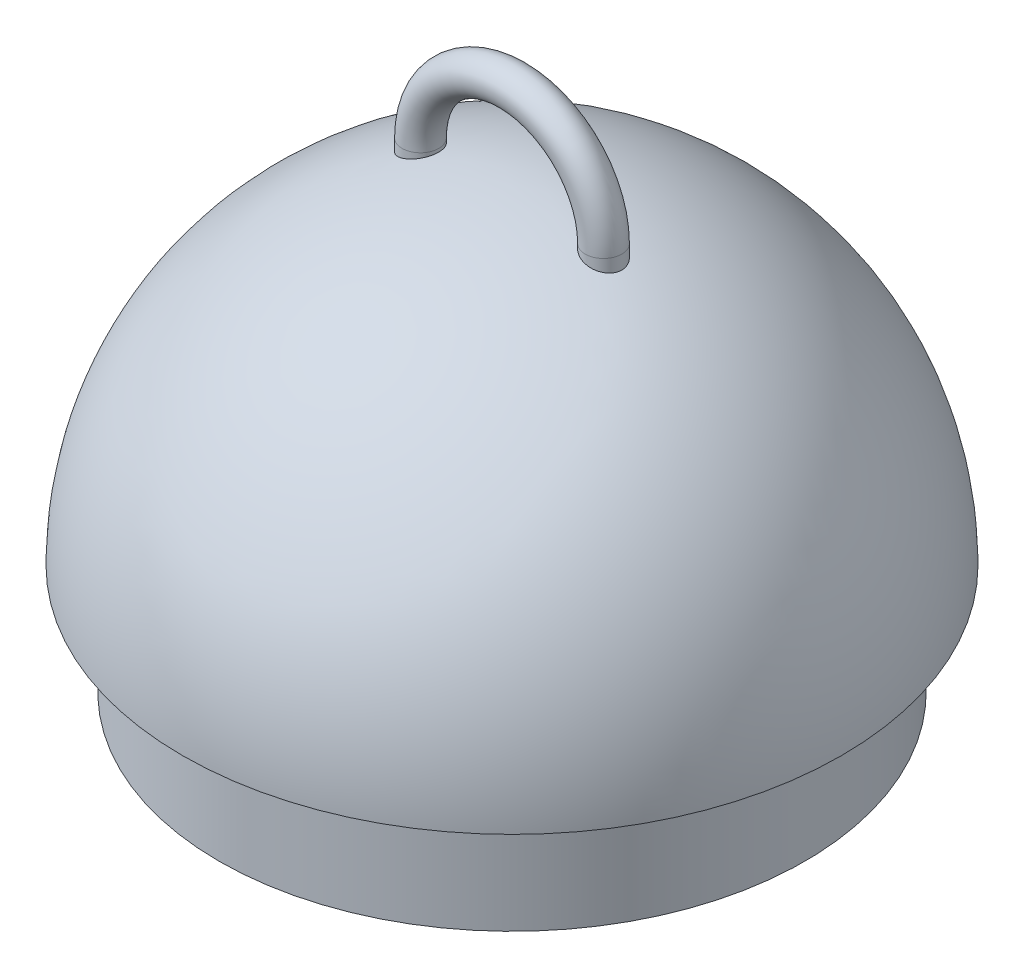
ISO-10303-21;
HEADER;
FILE_DESCRIPTION(('STEP AP214'),'2;1');
FILE_NAME('part.step','',(''),(''),'','','');
FILE_SCHEMA(('AUTOMOTIVE_DESIGN { 1 0 10303 214 1 1 1 1 }'));
ENDSEC;
DATA;
#1=APPLICATION_CONTEXT('core data for automotive mechanical design processes');
#2=APPLICATION_PROTOCOL_DEFINITION('international standard','automotive_design',2000,#1);
#3=PRODUCT_CONTEXT('',#1,'mechanical');
#4=PRODUCT('Part','Part','',(#3));
#5=PRODUCT_RELATED_PRODUCT_CATEGORY('part','',(#4));
#6=PRODUCT_DEFINITION_FORMATION('','',#4);
#7=PRODUCT_DEFINITION_CONTEXT('part definition',#1,'design');
#8=PRODUCT_DEFINITION('design','',#6,#7);
#9=PRODUCT_DEFINITION_SHAPE('','',#8);
#10=(LENGTH_UNIT() NAMED_UNIT(*) SI_UNIT(.MILLI.,.METRE.));
#11=(NAMED_UNIT(*) PLANE_ANGLE_UNIT() SI_UNIT($,.RADIAN.));
#12=(NAMED_UNIT(*) SI_UNIT($,.STERADIAN.) SOLID_ANGLE_UNIT());
#13=UNCERTAINTY_MEASURE_WITH_UNIT(LENGTH_MEASURE(1.E-05),#10,'distance_accuracy_value','');
#14=(GEOMETRIC_REPRESENTATION_CONTEXT(3) GLOBAL_UNCERTAINTY_ASSIGNED_CONTEXT((#13)) GLOBAL_UNIT_ASSIGNED_CONTEXT((#10,
#11,#12)) REPRESENTATION_CONTEXT('',''));
#15=CARTESIAN_POINT('',(0.,0.,0.));
#16=DIRECTION('',(0.,0.,1.));
#17=DIRECTION('',(1.,0.,0.));
#18=AXIS2_PLACEMENT_3D('',#15,#16,#17);
#19=CARTESIAN_POINT('',(0.,30.,0.));
#20=DIRECTION('',(0.,-1.,0.));
#21=DIRECTION('',(0.,0.,-1.));
#22=AXIS2_PLACEMENT_3D('',#19,#20,#21);
#23=CYLINDRICAL_SURFACE('',#22,80.);
#24=CARTESIAN_POINT('',(0.,30.,0.));
#25=DIRECTION('',(0.,1.,0.));
#26=DIRECTION('',(0.,0.,1.));
#27=AXIS2_PLACEMENT_3D('',#24,#25,#26);
#28=CIRCLE('',#27,80.);
#29=CARTESIAN_POINT('',(0.,30.,80.));
#30=VERTEX_POINT('',#29);
#31=EDGE_CURVE('E10',#30,#30,#28,.T.);
#32=ORIENTED_EDGE('',*,*,#31,.F.);
#33=EDGE_LOOP('',(#32));
#34=FACE_BOUND('',#33,.T.);
#35=CARTESIAN_POINT('',(0.,0.,0.));
#36=DIRECTION('',(0.,1.,0.));
#37=DIRECTION('',(0.,0.,1.));
#38=AXIS2_PLACEMENT_3D('',#35,#36,#37);
#39=CIRCLE('',#38,80.);
#40=CARTESIAN_POINT('',(0.,0.,80.));
#41=VERTEX_POINT('',#40);
#42=EDGE_CURVE('E56',#41,#41,#39,.T.);
#43=ORIENTED_EDGE('',*,*,#42,.T.);
#44=EDGE_LOOP('',(#43));
#45=FACE_BOUND('',#44,.T.);
#46=ADVANCED_FACE('F43',(#34,#45),#23,.T.);
#47=CARTESIAN_POINT('',(0.,0.,0.));
#48=DIRECTION('',(0.,1.,0.));
#49=DIRECTION('',(0.,0.,1.));
#50=AXIS2_PLACEMENT_3D('',#47,#48,#49);
#51=PLANE('',#50);
#52=ORIENTED_EDGE('',*,*,#42,.F.);
#53=EDGE_LOOP('',(#52));
#54=FACE_BOUND('',#53,.T.);
#55=ADVANCED_FACE('F91',(#54),#51,.F.);
#56=CARTESIAN_POINT('',(0.,30.,0.));
#57=DIRECTION('',(-1.,0.,0.));
#58=DIRECTION('',(0.,0.,-1.));
#59=AXIS2_PLACEMENT_3D('',#56,#57,#58);
#60=SPHERICAL_SURFACE('',#59,90.);
#61=CARTESIAN_POINT('',(-28.6440533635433,115.251377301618,-3.42357635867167));
#62=CARTESIAN_POINT('',(-28.5452385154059,115.280354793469,-3.52875500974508));
#63=CARTESIAN_POINT('',(-28.4420447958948,115.310601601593,-3.62946385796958));
#64=CARTESIAN_POINT('',(-28.2277098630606,115.373388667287,-3.82133293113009));
#65=CARTESIAN_POINT('',(-28.1165657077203,115.405929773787,-3.91248959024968));
#66=CARTESIAN_POINT('',(-27.8870981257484,115.473073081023,-4.08476122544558));
#67=CARTESIAN_POINT('',(-27.7687654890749,115.507677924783,-4.16586289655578));
#68=CARTESIAN_POINT('',(-27.5259173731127,115.57865032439,-4.31743442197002));
#69=CARTESIAN_POINT('',(-27.4013995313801,115.615018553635,-4.38790017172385));
#70=CARTESIAN_POINT('',(-27.1474356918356,115.689145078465,-4.51760926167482));
#71=CARTESIAN_POINT('',(-27.0180020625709,115.726899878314,-4.57687878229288));
#72=CARTESIAN_POINT('',(-26.7548521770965,115.803606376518,-4.68409151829));
#73=CARTESIAN_POINT('',(-26.6211343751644,115.842558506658,-4.73203059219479));
#74=CARTESIAN_POINT('',(-26.2151288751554,115.960745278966,-4.85835505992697));
#75=CARTESIAN_POINT('',(-25.9376475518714,116.041410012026,-4.91942125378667));
#76=CARTESIAN_POINT('',(-25.3700648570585,116.20616983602,-4.99470709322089));
#77=CARTESIAN_POINT('',(-25.0798207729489,116.290300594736,-5.00774650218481));
#78=CARTESIAN_POINT('',(-24.5011346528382,116.457794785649,-4.98346972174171));
#79=CARTESIAN_POINT('',(-24.2126929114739,116.54115809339,-4.94614550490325));
#80=CARTESIAN_POINT('',(-23.6430126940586,116.705571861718,-4.8212497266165));
#81=CARTESIAN_POINT('',(-23.3618713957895,116.78659199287,-4.73319363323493));
#82=CARTESIAN_POINT('',(-22.8180774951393,116.943097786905,-4.5084084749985));
#83=CARTESIAN_POINT('',(-22.5554238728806,117.018583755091,-4.37168209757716));
#84=CARTESIAN_POINT('',(-22.060970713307,117.160521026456,-4.05546549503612));
#85=CARTESIAN_POINT('',(-21.8287332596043,117.227100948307,-3.87671880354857));
#86=CARTESIAN_POINT('',(-21.3977105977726,117.350548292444,-3.47983862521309));
#87=CARTESIAN_POINT('',(-21.1989187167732,117.407417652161,-3.26171301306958));
#88=CARTESIAN_POINT('',(-20.8480787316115,117.507705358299,-2.80045307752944));
#89=CARTESIAN_POINT('',(-20.6946275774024,117.551527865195,-2.55847423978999));
#90=CARTESIAN_POINT('',(-20.4307538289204,117.626843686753,-2.05033741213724));
#91=CARTESIAN_POINT('',(-20.3203209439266,117.658339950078,-1.78418522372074));
#92=CARTESIAN_POINT('',(-20.1498607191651,117.706941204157,-1.24610821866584));
#93=CARTESIAN_POINT('',(-20.0880878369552,117.724544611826,-0.974780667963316));
#94=CARTESIAN_POINT('',(-20.0103843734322,117.74668601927,-0.425129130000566));
#95=CARTESIAN_POINT('',(-19.9944463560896,117.751226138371,-0.146806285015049));
#96=CARTESIAN_POINT('',(-20.0088102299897,117.747133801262,0.402073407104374));
#97=CARTESIAN_POINT('',(-20.0380515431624,117.738803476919,0.672661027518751));
#98=CARTESIAN_POINT('',(-20.139787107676,117.709810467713,1.20487630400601));
#99=CARTESIAN_POINT('',(-20.2122801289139,117.689148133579,1.46650421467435));
#100=CARTESIAN_POINT('',(-20.3981334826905,117.636145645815,1.97379628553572));
#101=CARTESIAN_POINT('',(-20.5115306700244,117.603794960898,2.21944581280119));
#102=CARTESIAN_POINT('',(-20.7754791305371,117.528437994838,2.6880792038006));
#103=CARTESIAN_POINT('',(-20.9260338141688,117.485430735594,2.91106098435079));
#104=CARTESIAN_POINT('',(-21.2636262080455,117.388907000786,3.33382727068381));
#105=CARTESIAN_POINT('',(-21.451443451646,117.335165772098,3.53293738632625));
#106=CARTESIAN_POINT('',(-21.8555100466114,117.219423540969,3.89694340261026));
#107=CARTESIAN_POINT('',(-22.0717641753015,117.157421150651,4.061833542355));
#108=CARTESIAN_POINT('',(-22.5349923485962,117.024450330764,4.35915345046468));
#109=CARTESIAN_POINT('',(-22.7828019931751,116.95323652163,4.49017148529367));
#110=CARTESIAN_POINT('',(-23.2954781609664,116.805711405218,4.70874766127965));
#111=CARTESIAN_POINT('',(-23.560347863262,116.729399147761,4.79629767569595));
#112=CARTESIAN_POINT('',(-24.1095924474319,116.570935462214,4.92846020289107));
#113=CARTESIAN_POINT('',(-24.3943257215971,116.488673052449,4.97145317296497));
#114=CARTESIAN_POINT('',(-24.9666558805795,116.323079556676,5.00810871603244));
#115=CARTESIAN_POINT('',(-25.2542531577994,116.239748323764,5.00176443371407));
#116=CARTESIAN_POINT('',(-25.8299515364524,116.072699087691,4.93928826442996));
#117=CARTESIAN_POINT('',(-26.1179572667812,115.989004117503,4.88220739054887));
#118=CARTESIAN_POINT('',(-26.6805075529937,115.825295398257,4.71824023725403));
#119=CARTESIAN_POINT('',(-26.9550519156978,115.745281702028,4.61135324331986));
#120=CARTESIAN_POINT('',(-27.4809687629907,115.591806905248,4.35088564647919));
#121=CARTESIAN_POINT('',(-27.7324765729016,115.518307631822,4.19760403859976));
#122=CARTESIAN_POINT('',(-28.0875334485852,115.414428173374,3.93559252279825));
#123=CARTESIAN_POINT('',(-28.2022385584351,115.38084752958,3.84285082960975));
#124=CARTESIAN_POINT('',(-28.4233619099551,115.316076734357,3.64723718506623));
#125=CARTESIAN_POINT('',(-28.5297837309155,115.284885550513,3.54436965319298));
#126=CARTESIAN_POINT('',(-28.7303672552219,115.226066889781,3.33241932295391));
#127=CARTESIAN_POINT('',(-28.8248007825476,115.198360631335,3.22361514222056));
#128=CARTESIAN_POINT('',(-29.0041769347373,115.145709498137,2.99788852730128));
#129=CARTESIAN_POINT('',(-29.0891234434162,115.120763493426,2.88096944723));
#130=CARTESIAN_POINT('',(-29.2488144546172,115.073849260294,2.63979060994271));
#131=CARTESIAN_POINT('',(-29.3235587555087,115.051881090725,2.5155307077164));
#132=CARTESIAN_POINT('',(-29.4621537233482,115.011132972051,2.26058238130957));
#133=CARTESIAN_POINT('',(-29.5260050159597,114.992352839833,2.1298943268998));
#134=CARTESIAN_POINT('',(-29.639841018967,114.958861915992,1.86851804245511));
#135=CARTESIAN_POINT('',(-29.6902847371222,114.94401649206,1.73804680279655));
#136=CARTESIAN_POINT('',(-29.7801377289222,114.917567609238,1.47304309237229));
#137=CARTESIAN_POINT('',(-29.8195475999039,114.905963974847,1.33851084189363));
#138=CARTESIAN_POINT('',(-29.886971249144,114.886109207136,1.06637831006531));
#139=CARTESIAN_POINT('',(-29.9149851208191,114.877858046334,0.928778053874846));
#140=CARTESIAN_POINT('',(-29.9593449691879,114.864791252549,0.65160331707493));
#141=CARTESIAN_POINT('',(-29.975695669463,114.859974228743,0.512029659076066));
#142=CARTESIAN_POINT('',(-29.9962657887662,114.853913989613,0.236304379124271));
#143=CARTESIAN_POINT('',(-30.0008482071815,114.852563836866,0.100182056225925));
#144=CARTESIAN_POINT('',(-29.9988944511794,114.853139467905,-0.171923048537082));
#145=CARTESIAN_POINT('',(-29.9923626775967,114.855063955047,-0.307905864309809));
#146=CARTESIAN_POINT('',(-29.9682404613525,114.862170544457,-0.578877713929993));
#147=CARTESIAN_POINT('',(-29.9506437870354,114.867354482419,-0.713866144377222));
#148=CARTESIAN_POINT('',(-29.9045513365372,114.880931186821,-0.981754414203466));
#149=CARTESIAN_POINT('',(-29.876059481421,114.88932279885,-1.11465498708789));
#150=CARTESIAN_POINT('',(-29.8086517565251,114.909172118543,-1.37660353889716));
#151=CARTESIAN_POINT('',(-29.7698063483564,114.920609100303,-1.50567123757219));
#152=CARTESIAN_POINT('',(-29.6819546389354,114.946468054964,-1.75993961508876));
#153=CARTESIAN_POINT('',(-29.6329519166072,114.960888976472,-1.88514163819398));
#154=CARTESIAN_POINT('',(-29.5252330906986,114.992579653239,-2.13078258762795));
#155=CARTESIAN_POINT('',(-29.4665258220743,115.009846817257,-2.25122572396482));
#156=CARTESIAN_POINT('',(-29.3398627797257,115.047088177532,-2.48665563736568));
#157=CARTESIAN_POINT('',(-29.2719096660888,115.067061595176,-2.60164397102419));
#158=CARTESIAN_POINT('',(-29.1176399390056,115.1123879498,-2.84039337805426));
#159=CARTESIAN_POINT('',(-29.0300829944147,115.138103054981,-2.96328656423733));
#160=CARTESIAN_POINT('',(-28.8446097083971,115.192548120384,-3.20025258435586));
#161=CARTESIAN_POINT('',(-28.746693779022,115.221277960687,-3.31432576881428));
#162=CARTESIAN_POINT('',(-28.6440533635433,115.251377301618,-3.42357635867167));
#163=B_SPLINE_CURVE_WITH_KNOTS('',3,(#61,#62,#63,#64,#65,#66,#67,#68,#69,#70,#71,#72,#73,#74,
#75,#76,#77,#78,#79,#80,#81,#82,#83,#84,#85,#86,#87,#88,#89,#90,#91,#92,#93,#94,#95,#96,#97,#98,
#99,#100,#101,#102,#103,#104,#105,#106,#107,#108,#109,#110,#111,#112,#113,#114,#115,#116,#117,
#118,#119,#120,#121,#122,#123,#124,#125,#126,#127,#128,#129,#130,#131,#132,#133,#134,#135,#136,
#137,#138,#139,#140,#141,#142,#143,#144,#145,#146,#147,#148,#149,#150,#151,#152,#153,#154,#155,
#156,#157,#158,#159,#160,#161,#162),.UNSPECIFIED.,.T.,.F.,(4,2,2,2,2,2,2,2,2,2,2,2,2,2,2,2,2,2,
2,2,2,2,2,2,2,2,2,2,2,2,2,2,2,2,2,2,2,2,2,2,2,2,2,2,2,2,2,2,2,2,4),(0.,0.441445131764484,
0.883054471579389,1.32524205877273,1.76759985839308,2.20891011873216,2.65038143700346,
3.53215081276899,4.43544995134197,5.33889308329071,6.25111137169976,7.1632792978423,
8.06038282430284,8.95730715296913,9.82255065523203,10.6875870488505,11.5199661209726,
12.3522101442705,13.1652121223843,13.9781909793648,14.7919041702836,15.6056920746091,
16.4387515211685,17.2719510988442,18.1356982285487,18.9996067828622,19.8939190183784,
20.7883555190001,21.6998822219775,22.6114220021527,23.5172080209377,23.970570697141,
24.4237363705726,24.8633224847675,25.3027279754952,25.7421421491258,26.181531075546,
26.6030162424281,27.0244785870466,27.4459374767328,27.8672255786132,28.2753535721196,
28.6833199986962,29.0915163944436,29.4995660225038,29.9049065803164,30.3101045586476,
30.7149356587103,31.1196505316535,31.5782042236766,32.0367396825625),.UNSPECIFIED.);
#164=CARTESIAN_POINT('',(-28.6440533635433,115.251377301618,-3.42357635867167));
#165=VERTEX_POINT('',#164);
#166=EDGE_CURVE('E46',#165,#165,#163,.T.);
#167=ORIENTED_EDGE('',*,*,#166,.T.);
#168=EDGE_LOOP('',(#167));
#169=FACE_BOUND('',#168,.T.);
#170=CARTESIAN_POINT('',(20.8636335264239,117.503247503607,-2.80899846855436));
#171=CARTESIAN_POINT('',(20.943726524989,117.48036463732,-2.92693906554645));
#172=CARTESIAN_POINT('',(21.0287367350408,117.456067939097,-3.04125956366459));
#173=CARTESIAN_POINT('',(21.2079011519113,117.404837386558,-3.26193079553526));
#174=CARTESIAN_POINT('',(21.3020586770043,117.377902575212,-3.36827861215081));
#175=CARTESIAN_POINT('',(21.4988382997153,117.321583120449,-3.57239251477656));
#176=CARTESIAN_POINT('',(21.601470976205,117.292195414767,-3.67014755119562));
#177=CARTESIAN_POINT('',(21.814316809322,117.231216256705,-3.85634894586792));
#178=CARTESIAN_POINT('',(21.9245328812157,117.199623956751,-3.94479169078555));
#179=CARTESIAN_POINT('',(22.1513872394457,117.134560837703,-4.11158949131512));
#180=CARTESIAN_POINT('',(22.2680086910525,117.101094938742,-4.18996933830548));
#181=CARTESIAN_POINT('',(22.5070661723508,117.032452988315,-4.33646938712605));
#182=CARTESIAN_POINT('',(22.6295043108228,116.997276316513,-4.40458583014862));
#183=CARTESIAN_POINT('',(23.0040774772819,116.889592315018,-4.59284280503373));
#184=CARTESIAN_POINT('',(23.2637702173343,116.814845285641,-4.69710970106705));
#185=CARTESIAN_POINT('',(23.8031842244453,116.659373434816,-4.86308437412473));
#186=CARTESIAN_POINT('',(24.0832634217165,116.578539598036,-4.92351226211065));
#187=CARTESIAN_POINT('',(24.6491524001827,116.414981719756,-4.99582392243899));
#188=CARTESIAN_POINT('',(24.9349633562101,116.33225729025,-5.00769763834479));
#189=CARTESIAN_POINT('',(25.5111500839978,116.165246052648,-4.98234872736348));
#190=CARTESIAN_POINT('',(25.8014785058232,116.08096737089,-4.94398399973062));
#191=CARTESIAN_POINT('',(26.3717859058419,115.915176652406,-4.81700579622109));
#192=CARTESIAN_POINT('',(26.6517644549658,115.833664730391,-4.7283902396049));
#193=CARTESIAN_POINT('',(27.1928058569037,115.675935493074,-4.50303864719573));
#194=CARTESIAN_POINT('',(27.4538938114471,115.599711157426,-4.36636793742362));
#195=CARTESIAN_POINT('',(27.9494848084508,115.454847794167,-4.04811359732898));
#196=CARTESIAN_POINT('',(28.1839911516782,115.386207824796,-3.86653555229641));
#197=CARTESIAN_POINT('',(28.6128396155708,115.260552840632,-3.46852773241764));
#198=CARTESIAN_POINT('',(28.8080847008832,115.203277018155,-3.25315433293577));
#199=CARTESIAN_POINT('',(29.1593176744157,115.100157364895,-2.79006495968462));
#200=CARTESIAN_POINT('',(29.3153151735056,115.054310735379,-2.5423569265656));
#201=CARTESIAN_POINT('',(29.5769336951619,114.977377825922,-2.03236132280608));
#202=CARTESIAN_POINT('',(29.684331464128,114.945771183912,-1.77106354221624));
#203=CARTESIAN_POINT('',(29.8537942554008,114.895882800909,-1.2329600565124));
#204=CARTESIAN_POINT('',(29.9158697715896,114.877597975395,-0.956157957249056));
#205=CARTESIAN_POINT('',(29.991035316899,114.855455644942,-0.405210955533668));
#206=CARTESIAN_POINT('',(30.0057449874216,114.851121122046,-0.13130514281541));
#207=CARTESIAN_POINT('',(29.9902271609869,114.855693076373,0.415102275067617));
#208=CARTESIAN_POINT('',(29.9600042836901,114.864598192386,0.687604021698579));
#209=CARTESIAN_POINT('',(29.8563707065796,114.895121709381,1.21995807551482));
#210=CARTESIAN_POINT('',(29.7835028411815,114.916580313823,1.47992569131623));
#211=CARTESIAN_POINT('',(29.5975089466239,114.971320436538,1.98368771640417));
#212=CARTESIAN_POINT('',(29.4843812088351,115.004602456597,2.2274814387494));
#213=CARTESIAN_POINT('',(29.2196271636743,115.082431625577,2.69595774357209));
#214=CARTESIAN_POINT('',(29.0674655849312,115.127135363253,2.92031134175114));
#215=CARTESIAN_POINT('',(28.7302507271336,115.226110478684,3.34032922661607));
#216=CARTESIAN_POINT('',(28.5451925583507,115.280383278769,3.53598924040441));
#217=CARTESIAN_POINT('',(28.140744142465,115.398866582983,3.90029570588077));
#218=CARTESIAN_POINT('',(27.9203947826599,115.463353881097,4.0677868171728));
#219=CARTESIAN_POINT('',(27.456626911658,115.598909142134,4.36356169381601));
#220=CARTESIAN_POINT('',(27.2132039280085,115.669978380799,4.49183783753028));
#221=CARTESIAN_POINT('',(26.6999551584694,115.819625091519,4.71073247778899));
#222=CARTESIAN_POINT('',(26.4294679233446,115.898387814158,4.79967432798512));
#223=CARTESIAN_POINT('',(25.8781115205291,116.058705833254,4.93043754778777));
#224=CARTESIAN_POINT('',(25.5972405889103,116.140261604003,4.97225087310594));
#225=CARTESIAN_POINT('',(25.0247880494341,116.306243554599,5.0083875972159));
#226=CARTESIAN_POINT('',(24.7331260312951,116.390686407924,5.00135564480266));
#227=CARTESIAN_POINT('',(24.1547857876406,116.557886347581,4.93661496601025));
#228=CARTESIAN_POINT('',(23.8681079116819,116.640643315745,4.87890269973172));
#229=CARTESIAN_POINT('',(23.4477420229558,116.761826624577,4.75521424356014));
#230=CARTESIAN_POINT('',(23.3088612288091,116.80183461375,4.70761616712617));
#231=CARTESIAN_POINT('',(23.0355157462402,116.880525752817,4.60025256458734));
#232=CARTESIAN_POINT('',(22.9010493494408,116.91920941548,4.54049181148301));
#233=CARTESIAN_POINT('',(22.637510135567,116.994976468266,4.40911983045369));
#234=CARTESIAN_POINT('',(22.5084392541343,117.032059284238,4.3375043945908));
#235=CARTESIAN_POINT('',(22.2568036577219,117.104311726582,4.18290159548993));
#236=CARTESIAN_POINT('',(22.1342362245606,117.139482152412,4.0999190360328));
#237=CARTESIAN_POINT('',(21.8990372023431,117.206933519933,3.92492884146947));
#238=CARTESIAN_POINT('',(21.7862518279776,117.239259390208,3.83314520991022));
#239=CARTESIAN_POINT('',(21.5687971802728,117.301552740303,3.63978101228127));
#240=CARTESIAN_POINT('',(21.4641244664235,117.331521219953,3.53820464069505));
#241=CARTESIAN_POINT('',(21.2637049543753,117.388875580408,3.32587104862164));
#242=CARTESIAN_POINT('',(21.1679604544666,117.416260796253,3.21511147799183));
#243=CARTESIAN_POINT('',(20.986309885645,117.468195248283,2.98525352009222));
#244=CARTESIAN_POINT('',(20.9003995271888,117.492745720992,2.86615880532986));
#245=CARTESIAN_POINT('',(20.7421313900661,117.537957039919,2.62499224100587));
#246=CARTESIAN_POINT('',(20.669390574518,117.558727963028,2.50319228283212));
#247=CARTESIAN_POINT('',(20.5343820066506,117.597267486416,2.253527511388));
#248=CARTESIAN_POINT('',(20.4721099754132,117.61503731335,2.12566520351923));
#249=CARTESIAN_POINT('',(20.358567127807,117.647429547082,1.86476304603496));
#250=CARTESIAN_POINT('',(20.3072961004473,117.662052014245,1.73172329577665));
#251=CARTESIAN_POINT('',(20.2162304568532,117.68801882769,1.4614649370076));
#252=CARTESIAN_POINT('',(20.1764352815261,117.69936333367,1.32424653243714));
#253=CARTESIAN_POINT('',(20.1099205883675,117.718322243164,1.05170470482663));
#254=CARTESIAN_POINT('',(20.0827803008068,117.726056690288,0.916492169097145));
#255=CARTESIAN_POINT('',(20.0397503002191,117.738318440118,0.644148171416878));
#256=CARTESIAN_POINT('',(20.0238601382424,117.742845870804,0.507016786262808));
#257=CARTESIAN_POINT('',(20.0034692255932,117.748655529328,0.231793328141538));
#258=CARTESIAN_POINT('',(19.9989724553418,117.749936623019,0.0937009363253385));
#259=CARTESIAN_POINT('',(20.0014202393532,117.749239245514,-0.182322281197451));
#260=CARTESIAN_POINT('',(20.0083604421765,117.747262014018,-0.320253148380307));
#261=CARTESIAN_POINT('',(20.0333844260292,117.740132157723,-0.592523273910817));
#262=CARTESIAN_POINT('',(20.0512665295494,117.735037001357,-0.726882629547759));
#263=CARTESIAN_POINT('',(20.0978324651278,117.721767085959,-0.993509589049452));
#264=CARTESIAN_POINT('',(20.1265122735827,117.713593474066,-1.12577795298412));
#265=CARTESIAN_POINT('',(20.1943951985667,117.694243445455,-1.38722181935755));
#266=CARTESIAN_POINT('',(20.2335879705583,117.683069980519,-1.51640022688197));
#267=CARTESIAN_POINT('',(20.3221635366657,117.657811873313,-1.77087378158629));
#268=CARTESIAN_POINT('',(20.3715434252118,117.64372806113,-1.89617002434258));
#269=CARTESIAN_POINT('',(20.4868668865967,117.610826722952,-2.15742312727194));
#270=CARTESIAN_POINT('',(20.5541077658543,117.591638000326,-2.29276256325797));
#271=CARTESIAN_POINT('',(20.7002904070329,117.549905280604,-2.55640733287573));
#272=CARTESIAN_POINT('',(20.7792317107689,117.527361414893,-2.68471294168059));
#273=CARTESIAN_POINT('',(20.8636335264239,117.503247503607,-2.80899846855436));
#274=B_SPLINE_CURVE_WITH_KNOTS('',3,(#170,#171,#172,#173,#174,#175,#176,#177,#178,#179,#180,
#181,#182,#183,#184,#185,#186,#187,#188,#189,#190,#191,#192,#193,#194,#195,#196,#197,#198,#199,
#200,#201,#202,#203,#204,#205,#206,#207,#208,#209,#210,#211,#212,#213,#214,#215,#216,#217,#218,
#219,#220,#221,#222,#223,#224,#225,#226,#227,#228,#229,#230,#231,#232,#233,#234,#235,#236,#237,
#238,#239,#240,#241,#242,#243,#244,#245,#246,#247,#248,#249,#250,#251,#252,#253,#254,#255,#256,
#257,#258,#259,#260,#261,#262,#263,#264,#265,#266,#267,#268,#269,#270,#271,#272,#273),
.UNSPECIFIED.,.T.,.F.,(4,2,2,2,2,2,2,2,2,2,2,2,2,2,2,2,2,2,2,2,2,2,2,2,2,2,2,2,2,2,2,2,2,2,2,2,
2,2,2,2,2,2,2,2,2,2,2,2,2,2,2,4),(0.,0.433028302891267,0.866214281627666,1.29994939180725,
1.73385218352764,2.16666459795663,2.59963513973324,3.46444928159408,4.35359412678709,
5.24292312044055,6.15282497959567,7.06276451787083,7.97147183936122,8.88006619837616,
9.76447476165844,10.6486665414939,11.497227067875,12.3455910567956,13.1646195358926,
13.9835638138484,14.7923036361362,15.6010777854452,16.4215981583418,17.2422405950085,
18.0910023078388,18.9399288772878,19.8221930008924,20.7046076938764,21.6116033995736,
22.5186624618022,22.9746990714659,23.4305570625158,23.886577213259,24.342405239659,
24.7887381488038,25.2348807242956,25.6811378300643,26.1271995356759,26.5568063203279,
26.9862370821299,27.4156596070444,27.845061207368,28.2589361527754,28.6727945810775,
29.0867975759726,29.5006430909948,29.9070813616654,30.3133683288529,30.7192569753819,
31.1250300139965,31.5813720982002,32.0376963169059),.UNSPECIFIED.);
#275=CARTESIAN_POINT('',(20.8636335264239,117.503247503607,-2.80899846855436));
#276=VERTEX_POINT('',#275);
#277=EDGE_CURVE('E66',#276,#276,#274,.T.);
#278=ORIENTED_EDGE('',*,*,#277,.T.);
#279=EDGE_LOOP('',(#278));
#280=FACE_BOUND('',#279,.T.);
#281=CARTESIAN_POINT('',(0.,30.,0.));
#282=DIRECTION('',(0.,-1.,0.));
#283=DIRECTION('',(0.,0.,-1.));
#284=AXIS2_PLACEMENT_3D('',#281,#282,#283);
#285=CIRCLE('',#284,90.);
#286=CARTESIAN_POINT('',(0.,30.0000000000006,-89.9999999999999));
#287=VERTEX_POINT('',#286);
#288=EDGE_CURVE('E62',#287,#287,#285,.T.);
#289=ORIENTED_EDGE('',*,*,#288,.F.);
#290=EDGE_LOOP('',(#289));
#291=FACE_BOUND('',#290,.T.);
#292=ADVANCED_FACE('F74',(#169,#280,#291),#60,.T.);
#293=CARTESIAN_POINT('',(0.,30.,0.));
#294=DIRECTION('',(0.,-1.,0.));
#295=DIRECTION('',(0.,0.,-1.));
#296=AXIS2_PLACEMENT_3D('',#293,#294,#295);
#297=PLANE('',#296);
#298=ORIENTED_EDGE('',*,*,#31,.T.);
#299=EDGE_LOOP('',(#298));
#300=FACE_BOUND('',#299,.T.);
#301=ORIENTED_EDGE('',*,*,#288,.T.);
#302=EDGE_LOOP('',(#301));
#303=FACE_BOUND('',#302,.T.);
#304=ADVANCED_FACE('F81',(#300,#303),#297,.T.);
#305=CARTESIAN_POINT('',(25.,118.618,0.));
#306=DIRECTION('',(0.,-1.,0.));
#307=DIRECTION('',(0.,0.,-1.));
#308=AXIS2_PLACEMENT_3D('',#305,#306,#307);
#309=CYLINDRICAL_SURFACE('',#308,5.);
#310=CARTESIAN_POINT('',(25.,118.618,0.));
#311=DIRECTION('',(0.,-1.,0.));
#312=DIRECTION('',(0.,0.,-1.));
#313=AXIS2_PLACEMENT_3D('',#310,#311,#312);
#314=CIRCLE('',#313,5.);
#315=CARTESIAN_POINT('',(30.0000000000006,118.618,0.));
#316=VERTEX_POINT('',#315);
#317=EDGE_CURVE('E149',#316,#316,#314,.T.);
#318=ORIENTED_EDGE('',*,*,#317,.T.);
#319=EDGE_LOOP('',(#318));
#320=FACE_BOUND('',#319,.T.);
#321=ORIENTED_EDGE('',*,*,#277,.F.);
#322=EDGE_LOOP('',(#321));
#323=FACE_BOUND('',#322,.T.);
#324=ADVANCED_FACE('F77',(#320,#323),#309,.T.);
#325=CARTESIAN_POINT('',(-25.,118.618,0.));
#326=DIRECTION('',(0.,-1.,0.));
#327=DIRECTION('',(0.,0.,-1.));
#328=AXIS2_PLACEMENT_3D('',#325,#326,#327);
#329=CYLINDRICAL_SURFACE('',#328,5.);
#330=CARTESIAN_POINT('',(-25.,118.618,0.));
#331=DIRECTION('',(0.,-1.,0.));
#332=DIRECTION('',(0.,0.,-1.));
#333=AXIS2_PLACEMENT_3D('',#330,#331,#332);
#334=CIRCLE('',#333,5.);
#335=CARTESIAN_POINT('',(-30.0000000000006,118.618,0.));
#336=VERTEX_POINT('',#335);
#337=EDGE_CURVE('E73',#336,#336,#334,.T.);
#338=ORIENTED_EDGE('',*,*,#337,.T.);
#339=EDGE_LOOP('',(#338));
#340=FACE_BOUND('',#339,.T.);
#341=ORIENTED_EDGE('',*,*,#166,.F.);
#342=EDGE_LOOP('',(#341));
#343=FACE_BOUND('',#342,.T.);
#344=ADVANCED_FACE('F80',(#340,#343),#329,.T.);
#345=CARTESIAN_POINT('',(0.,118.618,0.));
#346=DIRECTION('',(0.,0.,1.));
#347=DIRECTION('',(1.,0.,0.));
#348=AXIS2_PLACEMENT_3D('',#345,#346,#347);
#349=TOROIDAL_SURFACE('',#348,25.,5.00000000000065);
#350=CARTESIAN_POINT('',(0.,118.618,0.));
#351=DIRECTION('',(0.,0.,1.));
#352=DIRECTION('',(1.,0.,0.));
#353=AXIS2_PLACEMENT_3D('',#350,#351,#352);
#354=CIRCLE('',#353,30.0000000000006);
#355=EDGE_CURVE('',#316,#336,#354,.T.);
#356=ORIENTED_EDGE('',*,*,#317,.F.);
#357=ORIENTED_EDGE('',*,*,#337,.F.);
#358=ORIENTED_EDGE('',*,*,#355,.T.);
#359=ORIENTED_EDGE('',*,*,#355,.F.);
#360=EDGE_LOOP('',(#356,#358,#357,#359));
#361=FACE_BOUND('',#360,.T.);
#362=ADVANCED_FACE('F120',(#361),#349,.T.);
#363=CLOSED_SHELL('',(#46,#55,#292,#304,#324,#344,#362));
#364=MANIFOLD_SOLID_BREP('B2',#363);
#365=ADVANCED_BREP_SHAPE_REPRESENTATION('',(#18,#364),#14);
#366=SHAPE_DEFINITION_REPRESENTATION(#9,#365);
ENDSEC;
END-ISO-10303-21;
